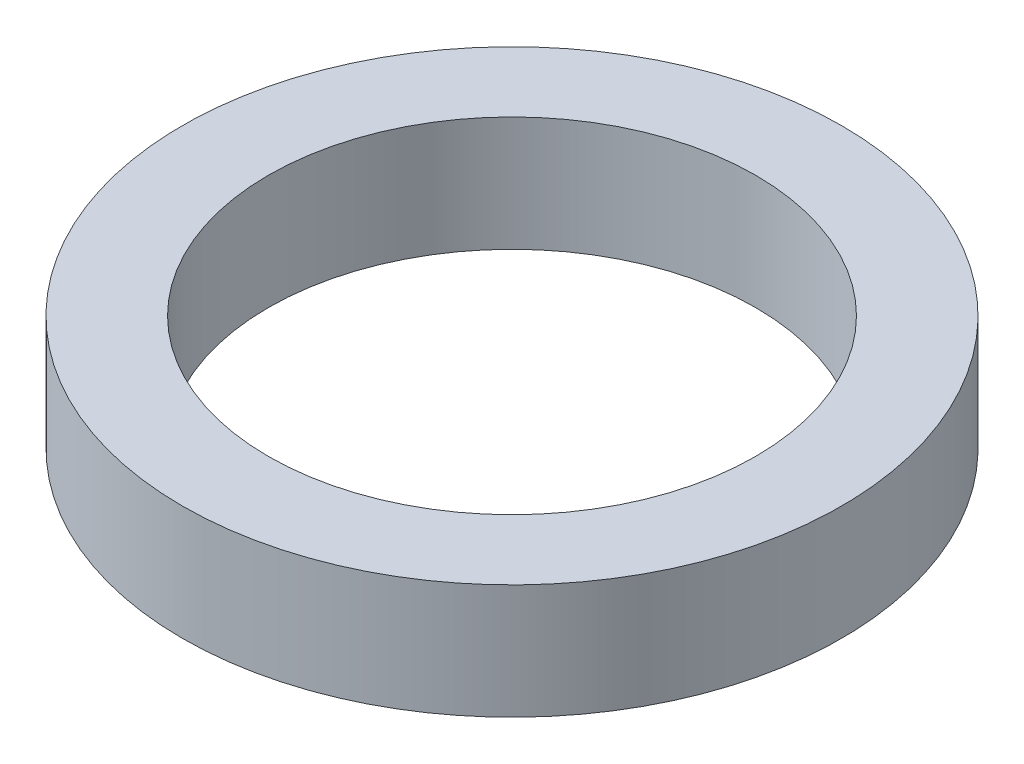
from build123d import *

# Parameters (mm, degrees)
CROQUIS1_R              = 5.75
CROQUIS1_R_2            = 4.25
SALIENTE_EXTRUIR1_DEPTH = 2


with BuildPart() as part:
    # Croquis1 → Saliente-Extruir1 (new body)
    with BuildSketch(Plane(origin=(0, 0, 0), x_dir=(1, 0, 0), z_dir=(0, 1, 0))):
        with Locations(Location((0, 0, 0), (0, 0, 270))):
            Circle(CROQUIS1_R)
        with Locations(Location((0, 0, 0), (0, 0, 270))):
            Circle(CROQUIS1_R_2, mode=Mode.SUBTRACT)
    extrude(amount=SALIENTE_EXTRUIR1_DEPTH)


solid = part.part
